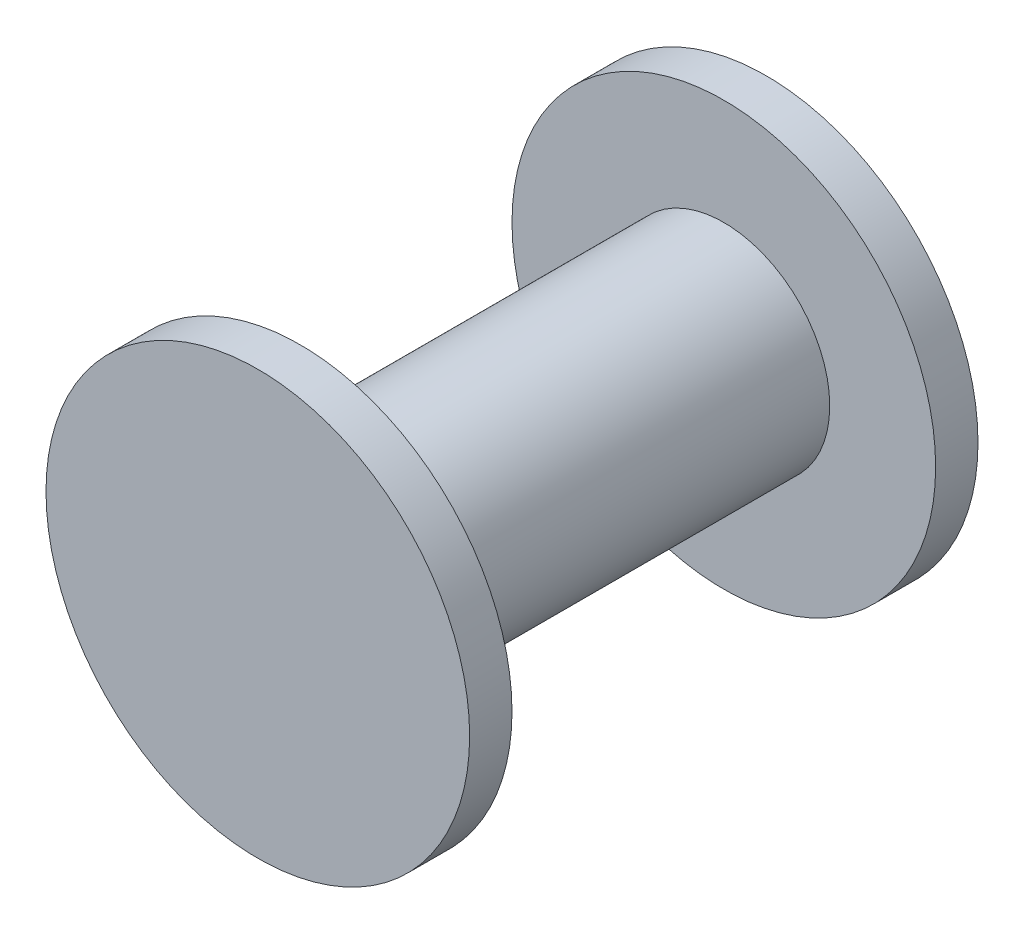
from build123d import *

# Parameters (mm, degrees)
SKETCH_1_R                    = 20
ROTOR_SHAFT_AND_FLANGES_DEPTH = 24
SKETCH_2_R                    = 20
SKETCH_2_R_2                  = 10
ROTOR_D20_FLANGES_D40_DEPTH   = 20


with BuildPart() as part:
    # Sketch 1 → Rotor_Shaft_and_Flanges (new, symmetric)
    with BuildSketch(Plane.XY):
        Circle(SKETCH_1_R)
    extrude(amount=ROTOR_SHAFT_AND_FLANGES_DEPTH, both=True)

    # Sketch 2 → Rotor_D20_Flanges_D40 (cut, symmetric)
    with BuildSketch(Plane.XY):
        Circle(SKETCH_2_R)
        Circle(SKETCH_2_R_2, mode=Mode.SUBTRACT)
    extrude(amount=ROTOR_D20_FLANGES_D40_DEPTH, both=True, mode=Mode.SUBTRACT)


solid = part.part
